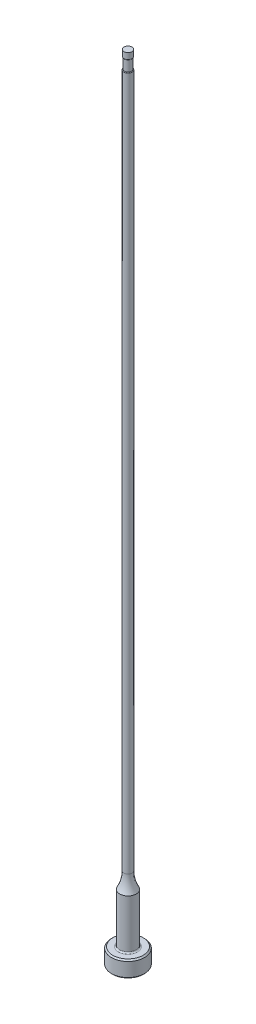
ISO-10303-21;
HEADER;
FILE_DESCRIPTION(('STEP AP214'),'2;1');
FILE_NAME('part.step','',(''),(''),'','','');
FILE_SCHEMA(('AUTOMOTIVE_DESIGN { 1 0 10303 214 1 1 1 1 }'));
ENDSEC;
DATA;
#1=APPLICATION_CONTEXT('core data for automotive mechanical design processes');
#2=APPLICATION_PROTOCOL_DEFINITION('international standard','automotive_design',2000,#1);
#3=PRODUCT_CONTEXT('',#1,'mechanical');
#4=PRODUCT('Part','Part','',(#3));
#5=PRODUCT_RELATED_PRODUCT_CATEGORY('part','',(#4));
#6=PRODUCT_DEFINITION_FORMATION('','',#4);
#7=PRODUCT_DEFINITION_CONTEXT('part definition',#1,'design');
#8=PRODUCT_DEFINITION('design','',#6,#7);
#9=PRODUCT_DEFINITION_SHAPE('','',#8);
#10=(LENGTH_UNIT() NAMED_UNIT(*) SI_UNIT(.MILLI.,.METRE.));
#11=(NAMED_UNIT(*) PLANE_ANGLE_UNIT() SI_UNIT($,.RADIAN.));
#12=(NAMED_UNIT(*) SI_UNIT($,.STERADIAN.) SOLID_ANGLE_UNIT());
#13=UNCERTAINTY_MEASURE_WITH_UNIT(LENGTH_MEASURE(1.E-05),#10,'distance_accuracy_value','');
#14=(GEOMETRIC_REPRESENTATION_CONTEXT(3) GLOBAL_UNCERTAINTY_ASSIGNED_CONTEXT((#13)) GLOBAL_UNIT_ASSIGNED_CONTEXT((#10,
#11,#12)) REPRESENTATION_CONTEXT('',''));
#15=CARTESIAN_POINT('',(0.,0.,0.));
#16=DIRECTION('',(0.,0.,1.));
#17=DIRECTION('',(1.,0.,0.));
#18=AXIS2_PLACEMENT_3D('',#15,#16,#17);
#19=CARTESIAN_POINT('',(0.,259.958771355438,0.));
#20=DIRECTION('',(0.,1.,0.));
#21=DIRECTION('',(0.,0.,1.));
#22=AXIS2_PLACEMENT_3D('',#19,#20,#21);
#23=CYLINDRICAL_SURFACE('',#22,0.79374999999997);
#24=DIRECTION('',(0.,1.,0.));
#25=VECTOR('',#24,1.);
#26=CARTESIAN_POINT('',(-0.692149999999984,259.958771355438,-0.388545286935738));
#27=LINE('',#26,#25);
#28=CARTESIAN_POINT('',(-0.692149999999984,148.973565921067,-0.388545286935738));
#29=VERTEX_POINT('',#28);
#30=CARTESIAN_POINT('',(-0.692149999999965,112.014,-0.388545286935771));
#31=VERTEX_POINT('',#30);
#32=EDGE_CURVE('E66',#29,#31,#27,.F.);
#33=ORIENTED_EDGE('',*,*,#32,.F.);
#34=CARTESIAN_POINT('',(0.,148.973565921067,0.));
#35=DIRECTION('',(0.,1.,0.));
#36=DIRECTION('',(0.,0.,1.));
#37=AXIS2_PLACEMENT_3D('',#34,#35,#36);
#38=CIRCLE('',#37,0.79374999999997);
#39=CARTESIAN_POINT('',(-0.692149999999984,148.973565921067,0.388545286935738));
#40=VERTEX_POINT('',#39);
#41=EDGE_CURVE('E44',#29,#40,#38,.F.);
#42=ORIENTED_EDGE('',*,*,#41,.T.);
#43=DIRECTION('',(0.,1.,0.));
#44=VECTOR('',#43,1.);
#45=CARTESIAN_POINT('',(-0.692149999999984,259.958771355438,0.388545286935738));
#46=LINE('',#45,#44);
#47=CARTESIAN_POINT('',(-0.692149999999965,112.014,0.388545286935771));
#48=VERTEX_POINT('',#47);
#49=EDGE_CURVE('E72',#48,#40,#46,.T.);
#50=ORIENTED_EDGE('',*,*,#49,.F.);
#51=CARTESIAN_POINT('',(-0.692149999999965,112.014,-0.388545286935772));
#52=CARTESIAN_POINT('',(-0.692147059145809,111.980595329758,-0.388529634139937));
#53=CARTESIAN_POINT('',(-0.692677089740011,111.947184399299,-0.387605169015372));
#54=CARTESIAN_POINT('',(-0.694785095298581,111.880441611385,-0.383825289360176));
#55=CARTESIAN_POINT('',(-0.696365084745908,111.847110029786,-0.380966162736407));
#56=CARTESIAN_POINT('',(-0.700560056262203,111.780665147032,-0.373193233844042));
#57=CARTESIAN_POINT('',(-0.703177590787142,111.747552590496,-0.368274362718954));
#58=CARTESIAN_POINT('',(-0.70939790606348,111.681866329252,-0.356147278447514));
#59=CARTESIAN_POINT('',(-0.712999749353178,111.649292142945,-0.348941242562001));
#60=CARTESIAN_POINT('',(-0.720516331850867,111.589629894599,-0.333107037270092));
#61=CARTESIAN_POINT('',(-0.724309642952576,111.562432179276,-0.324837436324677));
#62=CARTESIAN_POINT('',(-0.732469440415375,111.508890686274,-0.305996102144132));
#63=CARTESIAN_POINT('',(-0.736836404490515,111.482547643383,-0.295422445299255));
#64=CARTESIAN_POINT('',(-0.746025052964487,111.430994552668,-0.271391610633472));
#65=CARTESIAN_POINT('',(-0.75085027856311,111.405796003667,-0.257910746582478));
#66=CARTESIAN_POINT('',(-0.760636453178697,111.357650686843,-0.227438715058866));
#67=CARTESIAN_POINT('',(-0.765596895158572,111.334696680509,-0.210459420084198));
#68=CARTESIAN_POINT('',(-0.772863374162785,111.302559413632,-0.181185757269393));
#69=CARTESIAN_POINT('',(-0.775317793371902,111.291987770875,-0.170459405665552));
#70=CARTESIAN_POINT('',(-0.779981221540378,111.272302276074,-0.147661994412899));
#71=CARTESIAN_POINT('',(-0.782190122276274,111.263189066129,-0.135590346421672));
#72=CARTESIAN_POINT('',(-0.786212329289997,111.24684932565,-0.10990918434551));
#73=CARTESIAN_POINT('',(-0.788019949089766,111.239649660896,-0.0962812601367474));
#74=CARTESIAN_POINT('',(-0.790974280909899,111.227994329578,-0.0678329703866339));
#75=CARTESIAN_POINT('',(-0.792122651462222,111.223531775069,-0.0530157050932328));
#76=CARTESIAN_POINT('',(-0.793477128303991,111.218282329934,-0.0246588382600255));
#77=CARTESIAN_POINT('',(-0.793785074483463,111.217097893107,-0.0111986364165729));
#78=CARTESIAN_POINT('',(-0.793708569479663,111.217392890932,0.0156909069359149));
#79=CARTESIAN_POINT('',(-0.793324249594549,111.218871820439,0.0291202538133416));
#80=CARTESIAN_POINT('',(-0.792034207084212,111.223877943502,0.0533347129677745));
#81=CARTESIAN_POINT('',(-0.791220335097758,111.227045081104,0.064202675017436));
#82=CARTESIAN_POINT('',(-0.789221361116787,111.234900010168,0.0853309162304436));
#83=CARTESIAN_POINT('',(-0.78803617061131,111.239588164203,0.0955910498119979));
#84=CARTESIAN_POINT('',(-0.784691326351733,111.252986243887,0.120537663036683));
#85=CARTESIAN_POINT('',(-0.782345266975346,111.262520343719,0.134755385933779));
#86=CARTESIAN_POINT('',(-0.777271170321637,111.283662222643,0.161475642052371));
#87=CARTESIAN_POINT('',(-0.774542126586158,111.295275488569,0.173973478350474));
#88=CARTESIAN_POINT('',(-0.76709792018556,111.327902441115,0.204925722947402));
#89=CARTESIAN_POINT('',(-0.762235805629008,111.350152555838,0.222031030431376));
#90=CARTESIAN_POINT('',(-0.752599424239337,111.396926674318,0.252764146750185));
#91=CARTESIAN_POINT('',(-0.747825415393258,111.421456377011,0.26638290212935));
#92=CARTESIAN_POINT('',(-0.734693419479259,111.493796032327,0.30145019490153));
#93=CARTESIAN_POINT('',(-0.726816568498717,111.543351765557,0.319450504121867));
#94=CARTESIAN_POINT('',(-0.713277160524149,111.644727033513,0.348596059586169));
#95=CARTESIAN_POINT('',(-0.707621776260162,111.696553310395,0.359719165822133));
#96=CARTESIAN_POINT('',(-0.699557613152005,111.792820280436,0.375130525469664));
#97=CARTESIAN_POINT('',(-0.696772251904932,111.837103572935,0.380231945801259));
#98=CARTESIAN_POINT('',(-0.693072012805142,111.925601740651,0.386898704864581));
#99=CARTESIAN_POINT('',(-0.692139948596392,111.969813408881,0.388496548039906));
#100=CARTESIAN_POINT('',(-0.692149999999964,112.014,0.388545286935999));
#101=B_SPLINE_CURVE_WITH_KNOTS('',3,(#51,#52,#53,#54,#55,#56,#57,#58,#59,#60,#61,#62,#63,#64,
#65,#66,#67,#68,#69,#70,#71,#72,#73,#74,#75,#76,#77,#78,#79,#80,#81,#82,#83,#84,#85,#86,#87,#88,
#89,#90,#91,#92,#93,#94,#95,#96,#97,#98,#99,#100),.UNSPECIFIED.,.F.,.F.,(4,2,2,2,2,2,2,2,2,2,2,
2,2,2,2,2,2,2,2,2,2,2,2,2,4),(0.,0.100207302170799,0.20060742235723,0.30125608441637,
0.401809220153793,0.487757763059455,0.573778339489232,0.660528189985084,0.746988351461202,
0.792665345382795,0.838362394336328,0.884670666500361,0.930861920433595,0.971137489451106,
1.01140542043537,1.04531885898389,1.0792403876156,1.13077999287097,1.1824576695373,
1.26742509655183,1.35261096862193,1.51165072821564,1.67119985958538,1.80500866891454,
1.93757071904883),.UNSPECIFIED.);
#102=EDGE_CURVE('E74',#31,#48,#101,.T.);
#103=ORIENTED_EDGE('',*,*,#102,.F.);
#104=EDGE_LOOP('',(#33,#42,#50,#103));
#105=FACE_BOUND('',#104,.T.);
#106=CARTESIAN_POINT('',(0.,15.7741805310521,0.));
#107=DIRECTION('',(0.,1.,0.));
#108=DIRECTION('',(0.,0.,1.));
#109=AXIS2_PLACEMENT_3D('',#106,#107,#108);
#110=CIRCLE('',#109,0.79374999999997);
#111=CARTESIAN_POINT('',(0.,15.7741805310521,0.79374999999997));
#112=VERTEX_POINT('',#111);
#113=EDGE_CURVE('E95',#112,#112,#110,.T.);
#114=ORIENTED_EDGE('',*,*,#113,.T.);
#115=EDGE_LOOP('',(#114));
#116=FACE_BOUND('',#115,.T.);
#117=ADVANCED_FACE('F36',(#105,#116),#23,.T.);
#118=CARTESIAN_POINT('',(0.,15.7741805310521,0.));
#119=DIRECTION('',(0.,1.,0.));
#120=DIRECTION('',(0.,0.,1.));
#121=AXIS2_PLACEMENT_3D('',#118,#119,#120);
#122=TOROIDAL_SURFACE('',#121,7.14374999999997,6.35);
#123=CARTESIAN_POINT('',(0.,12.7,0.));
#124=DIRECTION('',(0.,1.,0.));
#125=DIRECTION('',(0.,0.,1.));
#126=AXIS2_PLACEMENT_3D('',#123,#124,#125);
#127=CIRCLE('',#126,1.58749999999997);
#128=CARTESIAN_POINT('',(0.,12.7,1.58749999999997));
#129=VERTEX_POINT('',#128);
#130=EDGE_CURVE('E92',#129,#129,#127,.T.);
#131=ORIENTED_EDGE('',*,*,#130,.T.);
#132=EDGE_LOOP('',(#131));
#133=FACE_BOUND('',#132,.T.);
#134=ORIENTED_EDGE('',*,*,#113,.F.);
#135=EDGE_LOOP('',(#134));
#136=FACE_BOUND('',#135,.T.);
#137=ADVANCED_FACE('F156',(#133,#136),#122,.F.);
#138=CARTESIAN_POINT('',(0.,259.958771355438,0.));
#139=DIRECTION('',(0.,1.,0.));
#140=DIRECTION('',(0.,0.,1.));
#141=AXIS2_PLACEMENT_3D('',#138,#139,#140);
#142=CYLINDRICAL_SURFACE('',#141,1.58749999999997);
#143=CARTESIAN_POINT('',(0.,3.42900000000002,0.));
#144=DIRECTION('',(0.,1.,0.));
#145=DIRECTION('',(0.,0.,1.));
#146=AXIS2_PLACEMENT_3D('',#143,#144,#145);
#147=CIRCLE('',#146,1.58749999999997);
#148=CARTESIAN_POINT('',(0.,3.42900000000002,1.58749999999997));
#149=VERTEX_POINT('',#148);
#150=EDGE_CURVE('E110',#149,#149,#147,.T.);
#151=ORIENTED_EDGE('',*,*,#150,.T.);
#152=EDGE_LOOP('',(#151));
#153=FACE_BOUND('',#152,.T.);
#154=ORIENTED_EDGE('',*,*,#130,.F.);
#155=EDGE_LOOP('',(#154));
#156=FACE_BOUND('',#155,.T.);
#157=ADVANCED_FACE('F153',(#153,#156),#142,.T.);
#158=CARTESIAN_POINT('',(-3.17499999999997,3.175,0.));
#159=DIRECTION('',(0.,1.,0.));
#160=DIRECTION('',(0.,0.,1.));
#161=AXIS2_PLACEMENT_3D('',#158,#159,#160);
#162=PLANE('',#161);
#163=CARTESIAN_POINT('',(0.,3.175,0.));
#164=DIRECTION('',(0.,1.,0.));
#165=DIRECTION('',(0.,0.,1.));
#166=AXIS2_PLACEMENT_3D('',#163,#164,#165);
#167=CIRCLE('',#166,1.84149999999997);
#168=CARTESIAN_POINT('',(0.,3.175,1.84149999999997));
#169=VERTEX_POINT('',#168);
#170=EDGE_CURVE('E78',#169,#169,#167,.F.);
#171=ORIENTED_EDGE('',*,*,#170,.T.);
#172=EDGE_LOOP('',(#171));
#173=FACE_BOUND('',#172,.T.);
#174=CARTESIAN_POINT('',(0.,3.175,0.));
#175=DIRECTION('',(0.,1.,0.));
#176=DIRECTION('',(0.,0.,1.));
#177=AXIS2_PLACEMENT_3D('',#174,#175,#176);
#178=CIRCLE('',#177,2.92099999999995);
#179=CARTESIAN_POINT('',(0.,3.175,2.92099999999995));
#180=VERTEX_POINT('',#179);
#181=EDGE_CURVE('E98',#180,#180,#178,.T.);
#182=ORIENTED_EDGE('',*,*,#181,.T.);
#183=EDGE_LOOP('',(#182));
#184=FACE_BOUND('',#183,.T.);
#185=ADVANCED_FACE('F149',(#173,#184),#162,.T.);
#186=CARTESIAN_POINT('',(0.,259.958771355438,0.));
#187=DIRECTION('',(0.,1.,0.));
#188=DIRECTION('',(0.,0.,1.));
#189=AXIS2_PLACEMENT_3D('',#186,#187,#188);
#190=CYLINDRICAL_SURFACE('',#189,3.17499999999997);
#191=CARTESIAN_POINT('',(0.,2.92100000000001,0.));
#192=DIRECTION('',(0.,1.,0.));
#193=DIRECTION('',(0.,0.,1.));
#194=AXIS2_PLACEMENT_3D('',#191,#192,#193);
#195=CIRCLE('',#194,3.17499999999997);
#196=CARTESIAN_POINT('',(0.,2.92100000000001,3.17499999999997));
#197=VERTEX_POINT('',#196);
#198=EDGE_CURVE('E104',#197,#197,#195,.F.);
#199=ORIENTED_EDGE('',*,*,#198,.T.);
#200=EDGE_LOOP('',(#199));
#201=FACE_BOUND('',#200,.T.);
#202=CARTESIAN_POINT('',(0.,0.254000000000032,0.));
#203=DIRECTION('',(0.,-1.,0.));
#204=DIRECTION('',(0.,0.,-1.));
#205=AXIS2_PLACEMENT_3D('',#202,#203,#204);
#206=CIRCLE('',#205,3.17499999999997);
#207=CARTESIAN_POINT('',(0.,0.254000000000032,-3.17499999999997));
#208=VERTEX_POINT('',#207);
#209=EDGE_CURVE('E101',#208,#208,#206,.F.);
#210=ORIENTED_EDGE('',*,*,#209,.T.);
#211=EDGE_LOOP('',(#210));
#212=FACE_BOUND('',#211,.T.);
#213=ADVANCED_FACE('F145',(#201,#212),#190,.T.);
#214=CARTESIAN_POINT('',(0.,0.,0.));
#215=DIRECTION('',(0.,-1.,0.));
#216=DIRECTION('',(0.,0.,-1.));
#217=AXIS2_PLACEMENT_3D('',#214,#215,#216);
#218=PLANE('',#217);
#219=CARTESIAN_POINT('',(0.,0.,0.));
#220=DIRECTION('',(0.,-1.,0.));
#221=DIRECTION('',(0.,0.,-1.));
#222=AXIS2_PLACEMENT_3D('',#219,#220,#221);
#223=CIRCLE('',#222,2.92099999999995);
#224=CARTESIAN_POINT('',(0.,0.,-2.92099999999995));
#225=VERTEX_POINT('',#224);
#226=EDGE_CURVE('E107',#225,#225,#223,.T.);
#227=ORIENTED_EDGE('',*,*,#226,.T.);
#228=EDGE_LOOP('',(#227));
#229=FACE_BOUND('',#228,.T.);
#230=ADVANCED_FACE('F141',(#229),#218,.T.);
#231=CARTESIAN_POINT('',(0.,3.17499999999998,0.));
#232=DIRECTION('',(0.,-1.,0.));
#233=DIRECTION('',(0.,0.,-1.));
#234=AXIS2_PLACEMENT_3D('',#231,#232,#233);
#235=CONICAL_SURFACE('',#234,2.92099999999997,0.7853981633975);
#236=ORIENTED_EDGE('',*,*,#198,.F.);
#237=EDGE_LOOP('',(#236));
#238=FACE_BOUND('',#237,.T.);
#239=ORIENTED_EDGE('',*,*,#181,.F.);
#240=EDGE_LOOP('',(#239));
#241=FACE_BOUND('',#240,.T.);
#242=ADVANCED_FACE('F144',(#238,#241),#235,.T.);
#243=CARTESIAN_POINT('',(0.,0.254000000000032,0.));
#244=DIRECTION('',(0.,1.,0.));
#245=DIRECTION('',(0.,0.,1.));
#246=AXIS2_PLACEMENT_3D('',#243,#244,#245);
#247=CONICAL_SURFACE('',#246,3.17499999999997,0.785398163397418);
#248=ORIENTED_EDGE('',*,*,#226,.F.);
#249=EDGE_LOOP('',(#248));
#250=FACE_BOUND('',#249,.T.);
#251=ORIENTED_EDGE('',*,*,#209,.F.);
#252=EDGE_LOOP('',(#251));
#253=FACE_BOUND('',#252,.T.);
#254=ADVANCED_FACE('F245',(#250,#253),#247,.T.);
#255=CARTESIAN_POINT('',(0.,3.42900000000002,0.));
#256=DIRECTION('',(0.,1.,0.));
#257=DIRECTION('',(0.,0.,1.));
#258=AXIS2_PLACEMENT_3D('',#255,#256,#257);
#259=TOROIDAL_SURFACE('',#258,1.84149999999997,0.254);
#260=ORIENTED_EDGE('',*,*,#170,.F.);
#261=EDGE_LOOP('',(#260));
#262=FACE_BOUND('',#261,.T.);
#263=ORIENTED_EDGE('',*,*,#150,.F.);
#264=EDGE_LOOP('',(#263));
#265=FACE_BOUND('',#264,.T.);
#266=ADVANCED_FACE('F139',(#262,#265),#259,.F.);
#267=CARTESIAN_POINT('',(0.,153.448281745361,0.));
#268=DIRECTION('',(0.,1.,0.));
#269=DIRECTION('',(0.,0.,1.));
#270=AXIS2_PLACEMENT_3D('',#267,#268,#269);
#271=CYLINDRICAL_SURFACE('',#270,0.69214999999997);
#272=CARTESIAN_POINT('',(0.,151.13,0.));
#273=DIRECTION('',(0.,1.,0.));
#274=DIRECTION('',(0.,0.,1.));
#275=AXIS2_PLACEMENT_3D('',#272,#273,#274);
#276=CIRCLE('',#275,0.69214999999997);
#277=CARTESIAN_POINT('',(0.,151.13,0.69214999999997));
#278=VERTEX_POINT('',#277);
#279=EDGE_CURVE('E71',#278,#278,#276,.T.);
#280=ORIENTED_EDGE('',*,*,#279,.F.);
#281=EDGE_LOOP('',(#280));
#282=FACE_BOUND('',#281,.T.);
#283=CARTESIAN_POINT('',(0.,149.098,0.));
#284=DIRECTION('',(0.,1.,0.));
#285=DIRECTION('',(0.,0.,1.));
#286=AXIS2_PLACEMENT_3D('',#283,#284,#285);
#287=CIRCLE('',#286,0.69214999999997);
#288=CARTESIAN_POINT('',(-0.69214999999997,149.098,0.));
#289=VERTEX_POINT('',#288);
#290=EDGE_CURVE('E89',#289,#289,#287,.T.);
#291=ORIENTED_EDGE('',*,*,#290,.T.);
#292=EDGE_LOOP('',(#291));
#293=FACE_BOUND('',#292,.T.);
#294=ADVANCED_FACE('F136',(#282,#293),#271,.T.);
#295=CARTESIAN_POINT('',(-0.69214999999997,150.114,-3.17499999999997));
#296=DIRECTION('',(1.,0.,0.));
#297=DIRECTION('',(0.,1.,0.));
#298=AXIS2_PLACEMENT_3D('',#295,#296,#297);
#299=PLANE('',#298);
#300=CARTESIAN_POINT('',(-0.692149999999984,148.973565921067,0.388545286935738));
#301=CARTESIAN_POINT('',(-0.692149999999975,148.977289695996,0.38855392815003));
#302=CARTESIAN_POINT('',(-0.692149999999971,148.981004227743,0.388211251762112));
#303=CARTESIAN_POINT('',(-0.692149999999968,148.988289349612,0.386898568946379));
#304=CARTESIAN_POINT('',(-0.692149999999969,148.991860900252,0.38593396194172));
#305=CARTESIAN_POINT('',(-0.69214999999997,148.998791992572,0.383453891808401));
#306=CARTESIAN_POINT('',(-0.69214999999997,149.00215209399,0.381939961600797));
#307=CARTESIAN_POINT('',(-0.69214999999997,149.00863226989,0.378456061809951));
#308=CARTESIAN_POINT('',(-0.69214999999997,149.011751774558,0.376485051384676));
#309=CARTESIAN_POINT('',(-0.69214999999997,149.01966563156,0.370784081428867));
#310=CARTESIAN_POINT('',(-0.69214999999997,149.024235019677,0.366742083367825));
#311=CARTESIAN_POINT('',(-0.69214999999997,149.032692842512,0.358002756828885));
#312=CARTESIAN_POINT('',(-0.69214999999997,149.036579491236,0.353303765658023));
#313=CARTESIAN_POINT('',(-0.69214999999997,149.046363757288,0.33990392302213));
#314=CARTESIAN_POINT('',(-0.69214999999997,149.051670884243,0.330775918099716));
#315=CARTESIAN_POINT('',(-0.69214999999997,149.060938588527,0.311873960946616));
#316=CARTESIAN_POINT('',(-0.69214999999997,149.064895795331,0.302098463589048));
#317=CARTESIAN_POINT('',(-0.69214999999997,149.07335470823,0.277716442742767));
#318=CARTESIAN_POINT('',(-0.69214999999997,149.07729702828,0.262919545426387));
#319=CARTESIAN_POINT('',(-0.69214999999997,149.083750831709,0.233007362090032));
#320=CARTESIAN_POINT('',(-0.69214999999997,149.086258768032,0.217891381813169));
#321=CARTESIAN_POINT('',(-0.69214999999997,149.092375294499,0.172181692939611));
#322=CARTESIAN_POINT('',(-0.69214999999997,149.094529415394,0.141404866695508));
#323=CARTESIAN_POINT('',(-0.69214999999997,149.096692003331,0.0920701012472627));
#324=CARTESIAN_POINT('',(-0.69214999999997,149.097212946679,0.0735164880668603));
#325=CARTESIAN_POINT('',(-0.69214999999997,149.097853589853,0.0366435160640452));
#326=CARTESIAN_POINT('',(-0.69214999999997,149.097978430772,0.0183242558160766));
#327=CARTESIAN_POINT('',(-0.69214999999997,149.098,0.));
#328=B_SPLINE_CURVE_WITH_KNOTS('',3,(#300,#301,#302,#303,#304,#305,#306,#307,#308,#309,#310,
#311,#312,#313,#314,#315,#316,#317,#318,#319,#320,#321,#322,#323,#324,#325,#326,#327),
.UNSPECIFIED.,.F.,.F.,(4,2,2,2,2,2,2,2,2,2,2,2,2,4),(0.,0.0111408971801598,0.0221863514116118,
0.0332012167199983,0.0442414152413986,0.0624374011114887,0.0806802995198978,0.112177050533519,
0.143751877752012,0.189567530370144,0.235495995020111,0.327902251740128,0.383589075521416,
0.43855010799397),.UNSPECIFIED.);
#329=EDGE_CURVE('E77',#40,#289,#328,.T.);
#330=ORIENTED_EDGE('',*,*,#329,.T.);
#331=CARTESIAN_POINT('',(-0.69214999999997,149.098,0.));
#332=CARTESIAN_POINT('',(-0.69214999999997,149.097997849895,-0.0105245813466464));
#333=CARTESIAN_POINT('',(-0.69214999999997,149.097951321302,-0.0210488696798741));
#334=CARTESIAN_POINT('',(-0.69214999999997,149.09775049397,-0.0420982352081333));
#335=CARTESIAN_POINT('',(-0.69214999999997,149.097596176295,-0.0526233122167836));
#336=CARTESIAN_POINT('',(-0.69214999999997,149.096939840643,-0.0843503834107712));
#337=CARTESIAN_POINT('',(-0.69214999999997,149.096243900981,-0.105550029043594));
#338=CARTESIAN_POINT('',(-0.69214999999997,149.093914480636,-0.148128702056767));
#339=CARTESIAN_POINT('',(-0.69214999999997,149.092271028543,-0.169507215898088));
#340=CARTESIAN_POINT('',(-0.69214999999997,149.087296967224,-0.212034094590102));
#341=CARTESIAN_POINT('',(-0.69214999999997,149.08397232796,-0.233183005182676));
#342=CARTESIAN_POINT('',(-0.69214999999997,149.077208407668,-0.262553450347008));
#343=CARTESIAN_POINT('',(-0.69214999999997,149.074990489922,-0.27105086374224));
#344=CARTESIAN_POINT('',(-0.69214999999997,149.069911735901,-0.287887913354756));
#345=CARTESIAN_POINT('',(-0.69214999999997,149.067048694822,-0.296226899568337));
#346=CARTESIAN_POINT('',(-0.69214999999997,149.059703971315,-0.314648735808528));
#347=CARTESIAN_POINT('',(-0.69214999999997,149.054996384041,-0.324643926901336));
#348=CARTESIAN_POINT('',(-0.69214999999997,149.043902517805,-0.343648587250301));
#349=CARTESIAN_POINT('',(-0.69214999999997,149.037528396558,-0.352664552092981));
#350=CARTESIAN_POINT('',(-0.69214999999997,149.027016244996,-0.363960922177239));
#351=CARTESIAN_POINT('',(-0.69214999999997,149.023779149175,-0.367075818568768));
#352=CARTESIAN_POINT('',(-0.69214999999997,149.016910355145,-0.372849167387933));
#353=CARTESIAN_POINT('',(-0.69214999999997,149.013278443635,-0.375507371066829));
#354=CARTESIAN_POINT('',(-0.69214999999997,149.005582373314,-0.380238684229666));
#355=CARTESIAN_POINT('',(-0.69214999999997,149.00151340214,-0.382304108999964));
#356=CARTESIAN_POINT('',(-0.69214999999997,148.993058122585,-0.38561458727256));
#357=CARTESIAN_POINT('',(-0.69214999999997,148.988672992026,-0.386862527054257));
#358=CARTESIAN_POINT('',(-0.69214999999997,148.982454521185,-0.387934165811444));
#359=CARTESIAN_POINT('',(-0.69214999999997,148.980685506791,-0.388162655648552));
#360=CARTESIAN_POINT('',(-0.69214999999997,148.977133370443,-0.388468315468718));
#361=CARTESIAN_POINT('',(-0.69214999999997,148.9753502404,-0.388545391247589));
#362=CARTESIAN_POINT('',(-0.69214999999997,148.973565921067,-0.388545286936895));
#363=B_SPLINE_CURVE_WITH_KNOTS('',3,(#331,#332,#333,#334,#335,#336,#337,#338,#339,#340,#341,
#342,#343,#344,#345,#346,#347,#348,#349,#350,#351,#352,#353,#354,#355,#356,#357,#358,#359,#360,
#361,#362),.UNSPECIFIED.,.F.,.F.,(4,2,2,2,2,2,2,2,2,2,2,2,2,2,2,4),(0.,0.0315729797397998,
0.0631515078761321,0.126771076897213,0.191072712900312,0.255147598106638,0.281475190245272,
0.307894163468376,0.340944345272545,0.373759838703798,0.38720552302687,0.40065850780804,
0.41427873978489,0.427850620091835,0.433196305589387,0.438545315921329),.UNSPECIFIED.);
#364=EDGE_CURVE('E58',#289,#29,#363,.T.);
#365=ORIENTED_EDGE('',*,*,#364,.T.);
#366=ORIENTED_EDGE('',*,*,#32,.T.);
#367=DIRECTION('',(0.,0.,1.));
#368=VECTOR('',#367,1.);
#369=CARTESIAN_POINT('',(-0.692149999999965,112.014,-3.17499999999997));
#370=LINE('',#369,#368);
#371=EDGE_CURVE('E70',#31,#48,#370,.T.);
#372=ORIENTED_EDGE('',*,*,#371,.T.);
#373=ORIENTED_EDGE('',*,*,#49,.T.);
#374=EDGE_LOOP('',(#330,#365,#366,#372,#373));
#375=FACE_BOUND('',#374,.T.);
#376=ADVANCED_FACE('F68',(#375),#299,.F.);
#377=CARTESIAN_POINT('',(-3.86714999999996,112.014,-3.17499999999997));
#378=DIRECTION('',(0.,0.,1.));
#379=DIRECTION('',(1.,0.,0.));
#380=AXIS2_PLACEMENT_3D('',#377,#378,#379);
#381=CYLINDRICAL_SURFACE('',#380,3.175);
#382=ORIENTED_EDGE('',*,*,#371,.F.);
#383=ORIENTED_EDGE('',*,*,#102,.T.);
#384=EDGE_LOOP('',(#382,#383));
#385=FACE_BOUND('',#384,.T.);
#386=ADVANCED_FACE('F80',(#385),#381,.F.);
#387=CARTESIAN_POINT('',(0.,152.687735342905,0.));
#388=DIRECTION('',(0.,1.,0.));
#389=DIRECTION('',(0.,0.,1.));
#390=AXIS2_PLACEMENT_3D('',#387,#388,#389);
#391=CYLINDRICAL_SURFACE('',#390,0.77469999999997);
#392=CARTESIAN_POINT('',(0.,151.24896721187,0.));
#393=DIRECTION('',(0.,-1.,0.));
#394=DIRECTION('',(0.,0.,-1.));
#395=AXIS2_PLACEMENT_3D('',#392,#393,#394);
#396=CIRCLE('',#395,0.77469999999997);
#397=CARTESIAN_POINT('',(0.,151.24896721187,-0.77469999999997));
#398=VERTEX_POINT('',#397);
#399=EDGE_CURVE('E11',#398,#398,#396,.F.);
#400=ORIENTED_EDGE('',*,*,#399,.T.);
#401=EDGE_LOOP('',(#400));
#402=FACE_BOUND('',#401,.T.);
#403=CARTESIAN_POINT('',(0.,152.4,0.));
#404=DIRECTION('',(0.,1.,0.));
#405=DIRECTION('',(0.,0.,1.));
#406=AXIS2_PLACEMENT_3D('',#403,#404,#405);
#407=CIRCLE('',#406,0.77469999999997);
#408=CARTESIAN_POINT('',(0.,152.4,0.77469999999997));
#409=VERTEX_POINT('',#408);
#410=EDGE_CURVE('E81',#409,#409,#407,.T.);
#411=ORIENTED_EDGE('',*,*,#410,.F.);
#412=EDGE_LOOP('',(#411));
#413=FACE_BOUND('',#412,.T.);
#414=ADVANCED_FACE('F133',(#402,#413),#391,.T.);
#415=CARTESIAN_POINT('',(-0.79374999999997,152.4,0.));
#416=DIRECTION('',(0.,1.,0.));
#417=DIRECTION('',(0.,0.,1.));
#418=AXIS2_PLACEMENT_3D('',#415,#416,#417);
#419=PLANE('',#418);
#420=ORIENTED_EDGE('',*,*,#410,.T.);
#421=EDGE_LOOP('',(#420));
#422=FACE_BOUND('',#421,.T.);
#423=ADVANCED_FACE('F177',(#422),#419,.T.);
#424=CARTESIAN_POINT('',(0.,148.973565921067,0.));
#425=DIRECTION('',(0.,1.,0.));
#426=DIRECTION('',(0.,0.,1.));
#427=AXIS2_PLACEMENT_3D('',#424,#425,#426);
#428=TOROIDAL_SURFACE('',#427,0.66674999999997,0.127);
#429=ORIENTED_EDGE('',*,*,#329,.F.);
#430=ORIENTED_EDGE('',*,*,#41,.F.);
#431=ORIENTED_EDGE('',*,*,#364,.F.);
#432=ORIENTED_EDGE('',*,*,#290,.F.);
#433=EDGE_LOOP('',(#429,#430,#431,#432));
#434=FACE_BOUND('',#433,.T.);
#435=ADVANCED_FACE('F209',(#434),#428,.T.);
#436=CARTESIAN_POINT('',(0.,151.24896721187,0.));
#437=DIRECTION('',(0.,-1.,0.));
#438=DIRECTION('',(0.,0.,-1.));
#439=AXIS2_PLACEMENT_3D('',#436,#437,#438);
#440=TOROIDAL_SURFACE('',#439,0.64769999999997,0.127);
#441=ORIENTED_EDGE('',*,*,#279,.T.);
#442=EDGE_LOOP('',(#441));
#443=FACE_BOUND('',#442,.T.);
#444=ORIENTED_EDGE('',*,*,#399,.F.);
#445=EDGE_LOOP('',(#444));
#446=FACE_BOUND('',#445,.T.);
#447=ADVANCED_FACE('F38',(#443,#446),#440,.T.);
#448=CLOSED_SHELL('',(#117,#137,#157,#185,#213,#230,#242,#254,#266,#294,#376,#386,#414,#423,
#435,#447));
#449=MANIFOLD_SOLID_BREP('B2',#448);
#450=ADVANCED_BREP_SHAPE_REPRESENTATION('',(#18,#449),#14);
#451=SHAPE_DEFINITION_REPRESENTATION(#9,#450);
ENDSEC;
END-ISO-10303-21;
